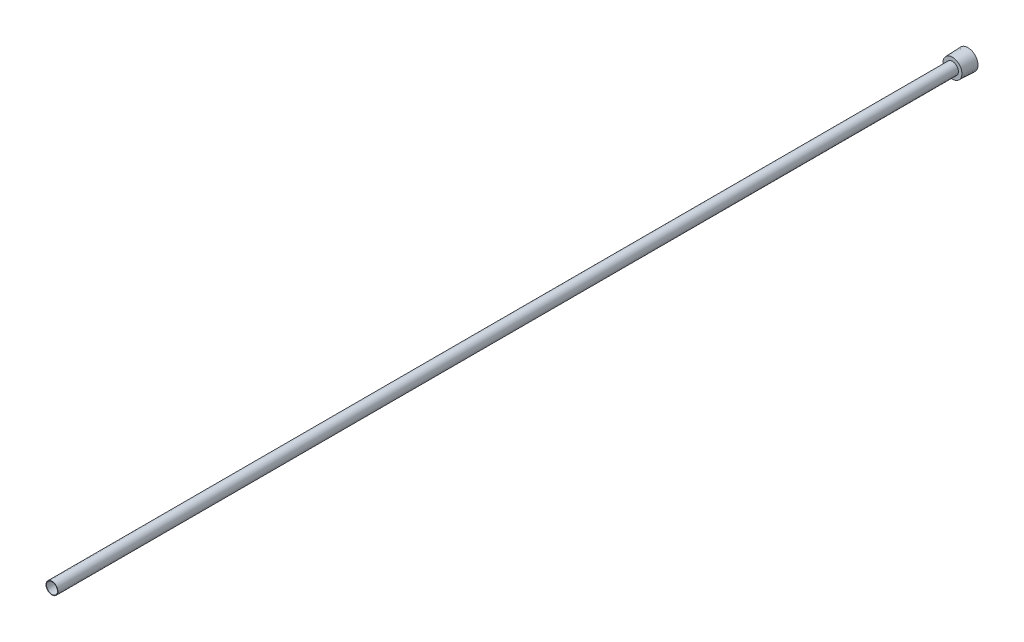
from build123d import *

# Parameters (mm, degrees)
SKETCH2_R          = 3.65125
CUT_EXTRUDE1_DEPTH = 610.674036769
CUT_EXTRUDE2_DEPTH = 6.35


with BuildPart() as part:
    # Sketch1 → Revolve1 (revolve)
    with BuildSketch(Plane(origin=(0, 0, 0), x_dir=(0, 0, -1), z_dir=(1, 0, 0)), mode=Mode.PRIVATE) as revolve1_sk:
        Polygon((0, 0), (-609.6, 0), (-609.6, 3.96875), (-10.3124, 3.96875), (-10.3124, 6.342143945), (0, 6.7183), align=None)
    revolve(revolve1_sk.sketch.rotate(Axis((0, 0, 331.124179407), (0, 0, -1)), 90), axis=Axis((0, 0, 331.124179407), (0, 0, -1)))

    # Sketch2 → Cut-Extrude1 (cut, through all)
    with BuildSketch(Plane.XY.offset(609.6)):
        Circle(SKETCH2_R)
    extrude(amount=-CUT_EXTRUDE1_DEPTH, mode=Mode.SUBTRACT)

    # Sketch3 → Cut-Extrude2 (cut)
    with BuildSketch(Plane(origin=(0, 0, 0), x_dir=(-1, 0, 0), z_dir=(0, 0, -1))):
        Polygon((-4.7625, -2.749630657), (0, -5.499261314), (4.7625, -2.749630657), (4.7625, 2.749630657), (0, 5.499261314), (-4.7625, 2.749630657), align=None)
    extrude(amount=-CUT_EXTRUDE2_DEPTH, mode=Mode.SUBTRACT)


solid = part.part
